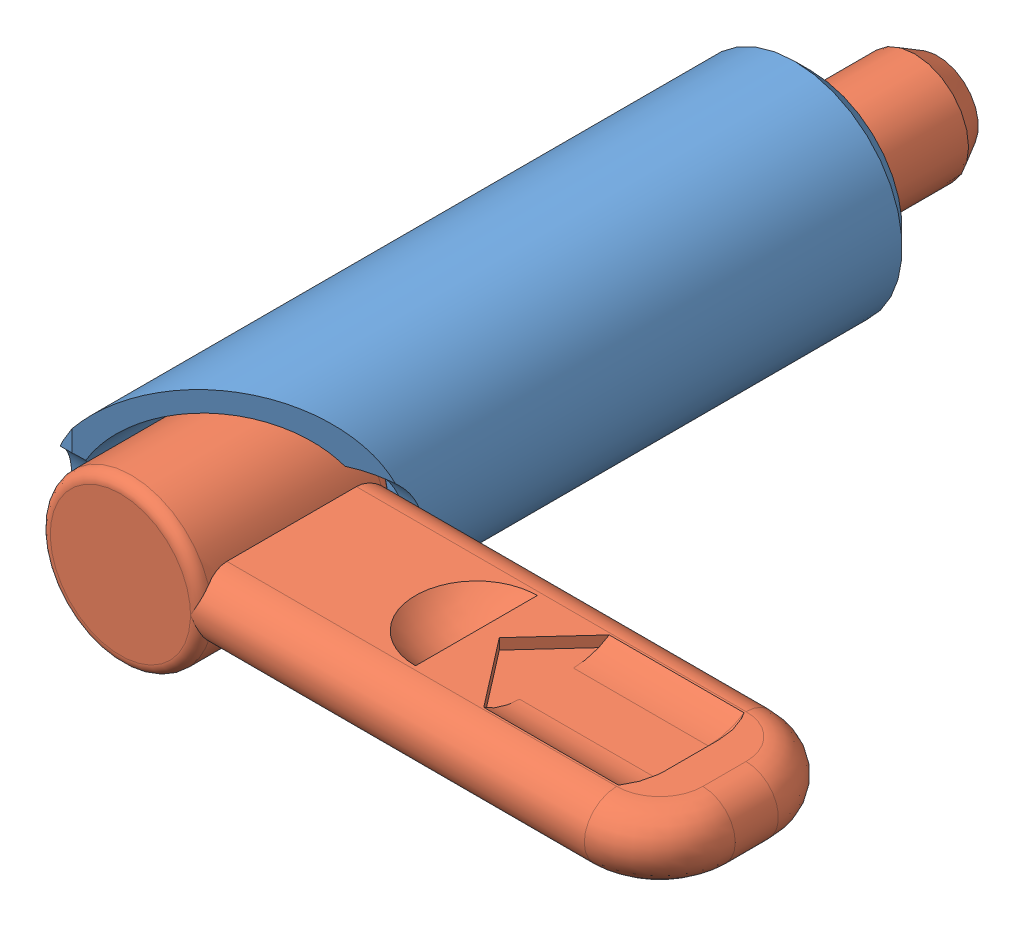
SolidWorks assembly GDX16L-8N-SUS.sldasm, configuration Default (file format 15000). Lengths in mm.
Overall size (48.01 16.01 61.21).
2 component instances, 2 part files, 0 mates.
Components (placement in the parent):
- GDX16L-8N-SUS_01-1: GDX16L-8N-SUS_01.SLDPRT [ﾃﾞﾌｫﾙﾄ] x (1 0 0) z (0 -1 0) size (16.02 50.53 16.01)
- GDX16L-8N-SUS_02-1: GDX16L-8N-SUS_02.SLDPRT [ﾃﾞﾌｫﾙﾄ] x (1 0 0) z (0 -1 0) size (46 61.21 12)
